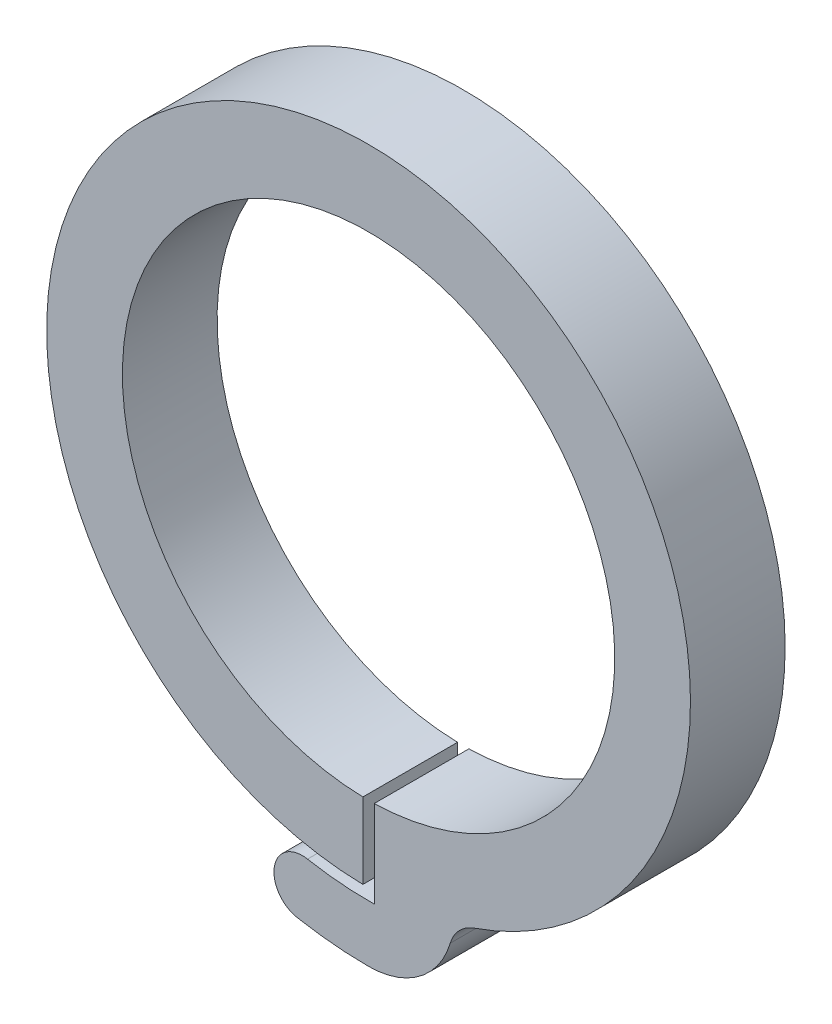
from build123d import *

# Parameters (mm, degrees)
BOSS_EXTRU_1_DEPTH = 2.5


with BuildPart() as part:
    # Esquisse1 → Boss.-Extru.1 (new, symmetric)
    with BuildSketch(Plane.XY):
        with BuildLine():
            Line((-0.3, -12.996538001), (-0.3, -16.997352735))
            ThreePointArc((-0.3, -16.997352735), (-2.678557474, 16.78765409), (5.574480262, -16.060048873))
            ThreePointArc((5.574480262, -16.060048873), (4.784617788, -16.567439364), (4.313285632, -17.379334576))
            ThreePointArc((4.313285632, -17.379334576), (2.69048466, -19.703654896), (0, -20.596538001))
            ThreePointArc((0, -20.596538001), (-1.895375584, -20.509142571), (-3.774666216, -20.247697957))
            ThreePointArc((-3.774666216, -20.247697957), (-4.973337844, -18.499693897), (-3.225333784, -17.30102227))
            ThreePointArc((-3.225333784, -17.30102227), (-1.47011116, -17.537586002), (0.3, -17.596538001))
            Line((0.3, -17.596538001), (0.3, -12.996538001))
            ThreePointArc((0.3, -12.996538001), (0, 13), (-0.3, -12.996538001))
        make_face()
    extrude(amount=BOSS_EXTRU_1_DEPTH, both=True)


solid = part.part
